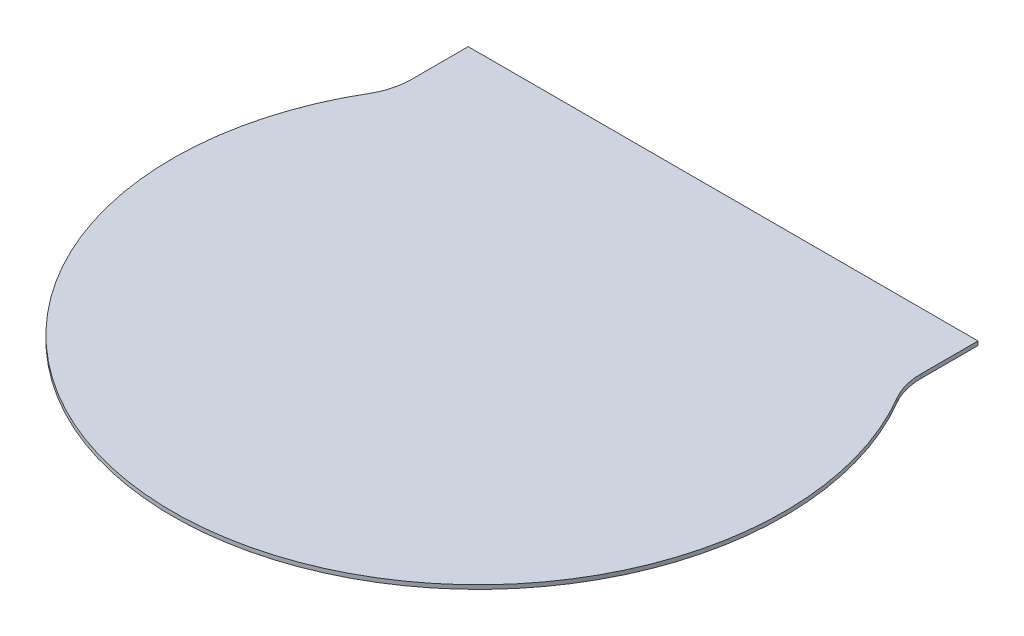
from build123d import *

# Parameters (mm, degrees)
EXTRUDE1_DEPTH = 0.05


with BuildPart() as part:
    # Sketch1 → Extrude1 (new body)
    with BuildSketch(Plane(origin=(0, 0, 0), x_dir=(1, 0, 0), z_dir=(0, 1, 0))):
        with BuildLine():
            ThreePointArc((3.175, 2.338317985), (3.203408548, 2.125306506), (3.286648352, 1.927185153))
            ThreePointArc((3.286648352, 1.927185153), (0, -3.81), (-3.286648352, 1.927185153))
            ThreePointArc((-3.286648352, 1.927185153), (-3.203408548, 2.125306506), (-3.175, 2.338317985))
            Line((-3.175, 2.338317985), (-3.175, 3.048))
            Line((-3.175, 3.048), (3.175, 3.048))
            Line((3.175, 3.048), (3.175, 2.338317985))
        make_face()
    extrude(amount=EXTRUDE1_DEPTH)


solid = part.part
